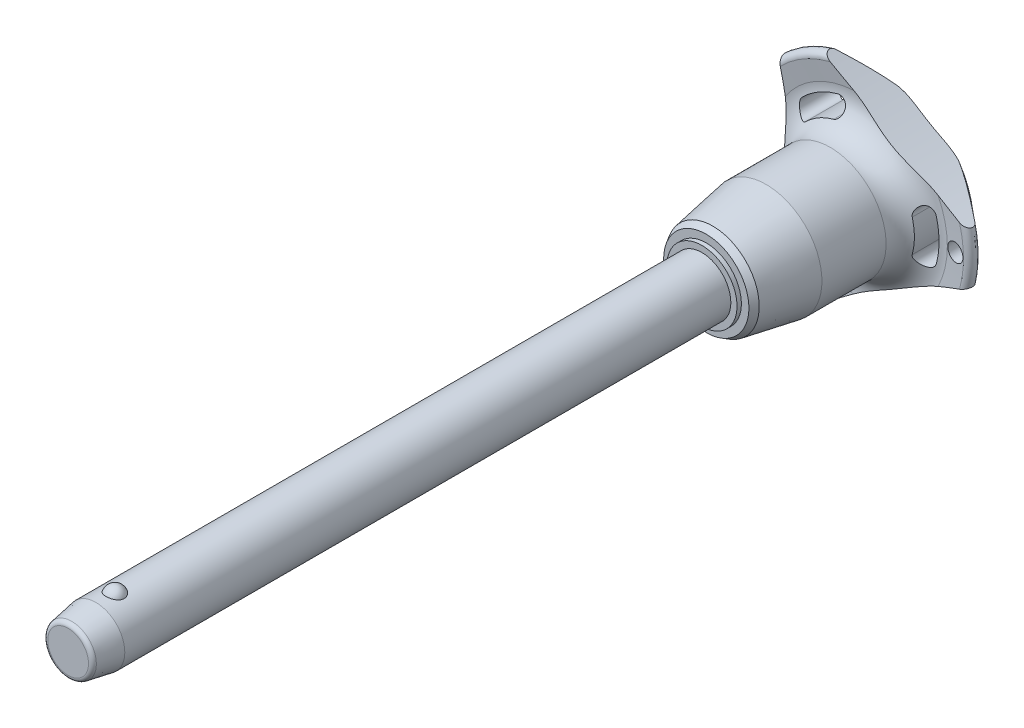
from build123d import *

# Parameters (mm, degrees)
SKETCH1_R           = 5
BOSS_EXTRUDE1_DEPTH = 100
SKETCH2_R           = 4.25
BOSS_EXTRUDE2_DEPTH = 33.3
BOSS_EXTRUDE3_START = 9.6
SKETCH1_2_R         = 5
BOSS_EXTRUDE3_DEPTH = 9.6
CHAMFER1_SIZE       = 4.8
CHAMFER1_SIZE2      = 0.846369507
FILLET1_R           = 0.75
SKETCH6_R           = 102.8
CUT_EXTRUDE1_DEPTH  = 137.15495075
CIRPATTERN1_COUNT   = 3
SKETCH7_R           = 1.5
CUT_EXTRUDE2_DEPTH  = 137.036109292


with BuildPart() as part:
    # Sketch1 → Boss-Extrude1 (new body)
    with BuildSketch(Plane.XY):
        Circle(SKETCH1_R)
    extrude(amount=-BOSS_EXTRUDE1_DEPTH)

    # Sketch2 → Boss-Extrude2 (add)
    with BuildSketch(Plane(origin=(0, 0, -100), x_dir=(-1, 0, 0), z_dir=(0, 0, -1))):
        Circle(SKETCH2_R)
    extrude(amount=BOSS_EXTRUDE2_DEPTH)

    # Sketch3 → Revolve1 (revolve)
    with BuildSketch(Plane(origin=(0, 0, 0), x_dir=(0, 0, -1), z_dir=(1, 0, 0))):
        with BuildLine():
            Line((-1.516575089, 6), (-1.516575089, 2.7))
            ThreePointArc((-1.516575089, 2.7), (0.133424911, 4.35), (-1.516575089, 6))
        make_face()
        with BuildLine():
            Line((-1.516575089, -2.7), (-1.516575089, -6))
            ThreePointArc((-1.516575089, -6), (0.133424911, -4.35), (-1.516575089, -2.7))
        make_face()
    revolve(axis=Axis((0, -2.7, 1.516575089), (0, 1, 0)))

    # Sketch1_2 → Boss-Extrude3 (add)
    with BuildSketch(Plane.XY.offset(BOSS_EXTRUDE3_START)):
        Circle(SKETCH1_2_R)
    extrude(amount=-BOSS_EXTRUDE3_DEPTH)

    # Chamfer1
    chamfer1_edges = [part.edges().sort_by_distance(p)[0] for p in [
        (-5, 0, 9.6),
    ]]
    chamfer1_side = [part.faces().sort_by_distance(p)[0] for p in [
        (-5, 0, -45.2),
    ]]
    chamfer(chamfer1_edges, length=CHAMFER1_SIZE, length2=CHAMFER1_SIZE2, reference=chamfer1_side[0])

    # Fillet1
    fillet1_edges = [part.edges().sort_by_distance(p)[0] for p in [
        (-4.153630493, 0, 9.6),
        (4.25, 0, -133.3),
    ]]
    fillet(fillet1_edges, radius=FILLET1_R)

    # Sketch4 → Revolve2 (revolve)
    with BuildSketch(Plane(origin=(0, 0, 0), x_dir=(0, 0, -1), z_dir=(1, 0, 0)), mode=Mode.PRIVATE) as revolve2_sk:
        Polygon((100, 0), (100, 6.067402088), (100.75, 6.067402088), (100.75, 7.371950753), (101.879772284, 8.024225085), (111.1, 9.65), (122.2, 9.65), (122.2, 0), align=None)
    revolve(revolve2_sk.sketch.rotate(Axis((0, 0, -122.2), (0, 0, 1)), 90), axis=Axis((0, 0, -122.2), (0, 0, 1)))

    # Sketch5 → Revolve3 (revolve)
    with BuildSketch(Plane(origin=(0, 0, 0), x_dir=(0, 0, -1), z_dir=(1, 0, 0)), mode=Mode.PRIVATE) as revolve3_sk:
        with BuildLine():
            Line((127.16082631, 15.274661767), (126.757834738, 18.475067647))
            ThreePointArc((126.757834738, 18.475067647), (127.349836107, 19.516443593), (128.516044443, 19.24278761))
            Line((128.516044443, 19.24278761), (132.835691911, 14.094832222))
            ThreePointArc((132.835691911, 14.094832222), (133.3, 12.689260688), (132.67067517, 11.349423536))
            ThreePointArc((132.67067517, 11.349423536), (129.033110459, 6.185112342), (127.75, 0))
            Line((127.75, 0), (122.2, 0))
            Line((122.2, 0), (122.2, 9.65))
            ThreePointArc((122.2, 9.65), (125.949887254, 11.342683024), (127.16082631, 15.274661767))
        make_face()
    revolve(revolve3_sk.sketch.rotate(Axis((0, 0, -127.75), (0, 0, 1)), 90), axis=Axis((0, 0, -127.75), (0, 0, 1)))

    # Sketch6 → Cut-Extrude1 (cut, through all)
    with BuildSketch(Plane.XY):
        with Locations((-115.2, 0)):
            Circle(SKETCH6_R)
        with BuildLine():
            ThreePointArc((13.411913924, -3.529271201), (13.868496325, 0), (13.411913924, 3.529271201))
            ThreePointArc((13.411913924, 3.529271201), (11.694200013, 4.531299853), (10.692171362, 2.813585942))
            ThreePointArc((10.692171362, 2.813585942), (11.056165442, 0), (10.692171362, -2.813585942))
            ThreePointArc((10.692171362, -2.813585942), (11.694200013, -4.531299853), (13.411913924, -3.529271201))
        make_face()
    cut_extrude1 = extrude(amount=-CUT_EXTRUDE1_DEPTH, mode=Mode.SUBTRACT)

    # CirPattern1: Cut-Extrude1 ×3 about axis
    cirpattern1_axis = Axis((0, 0, 0), (0, 0, 1))
    for i in range(1, CIRPATTERN1_COUNT):
        add(cut_extrude1.rotate(cirpattern1_axis, i * 360 / CIRPATTERN1_COUNT), mode=Mode.SUBTRACT)

    # Sketch7 → Cut-Extrude2 (cut, through all)
    with BuildSketch(Plane.XY):
        with Locations(Location((16.868496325, 0, 0), (0, 0, 225.467095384))):
            Circle(SKETCH7_R)
    extrude(amount=-CUT_EXTRUDE2_DEPTH, mode=Mode.SUBTRACT)


solid = part.part
